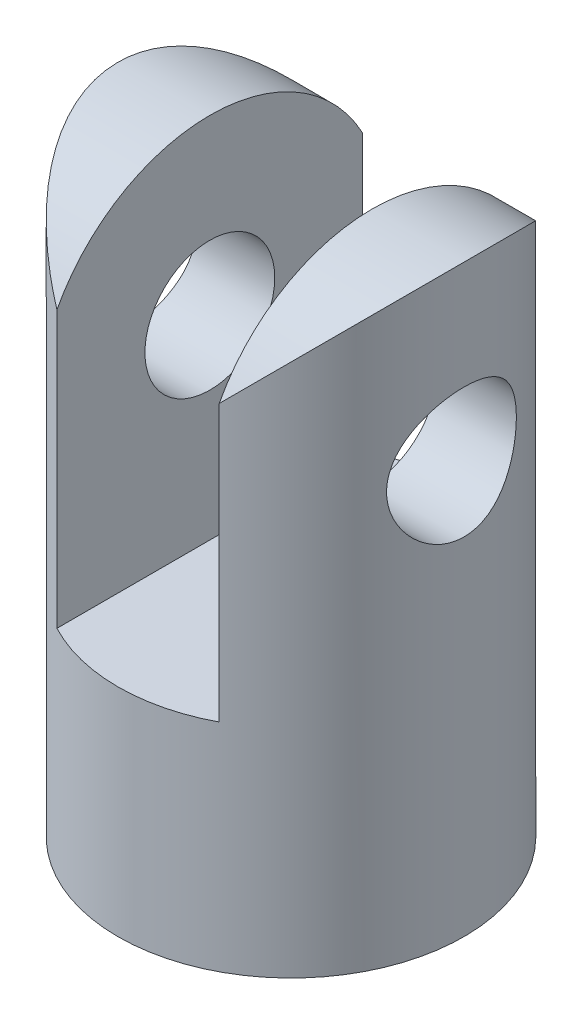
ISO-10303-21;
HEADER;
FILE_DESCRIPTION(('STEP AP214'),'2;1');
FILE_NAME('part.step','',(''),(''),'','','');
FILE_SCHEMA(('AUTOMOTIVE_DESIGN { 1 0 10303 214 1 1 1 1 }'));
ENDSEC;
DATA;
#1=APPLICATION_CONTEXT('core data for automotive mechanical design processes');
#2=APPLICATION_PROTOCOL_DEFINITION('international standard','automotive_design',2000,#1);
#3=PRODUCT_CONTEXT('',#1,'mechanical');
#4=PRODUCT('Part','Part','',(#3));
#5=PRODUCT_RELATED_PRODUCT_CATEGORY('part','',(#4));
#6=PRODUCT_DEFINITION_FORMATION('','',#4);
#7=PRODUCT_DEFINITION_CONTEXT('part definition',#1,'design');
#8=PRODUCT_DEFINITION('design','',#6,#7);
#9=PRODUCT_DEFINITION_SHAPE('','',#8);
#10=(LENGTH_UNIT() NAMED_UNIT(*) SI_UNIT(.MILLI.,.METRE.));
#11=(NAMED_UNIT(*) PLANE_ANGLE_UNIT() SI_UNIT($,.RADIAN.));
#12=(NAMED_UNIT(*) SI_UNIT($,.STERADIAN.) SOLID_ANGLE_UNIT());
#13=UNCERTAINTY_MEASURE_WITH_UNIT(LENGTH_MEASURE(1.E-05),#10,'distance_accuracy_value','');
#14=(GEOMETRIC_REPRESENTATION_CONTEXT(3) GLOBAL_UNCERTAINTY_ASSIGNED_CONTEXT((#13)) GLOBAL_UNIT_ASSIGNED_CONTEXT((#10,
#11,#12)) REPRESENTATION_CONTEXT('',''));
#15=CARTESIAN_POINT('',(0.,0.,0.));
#16=DIRECTION('',(0.,0.,1.));
#17=DIRECTION('',(1.,0.,0.));
#18=AXIS2_PLACEMENT_3D('',#15,#16,#17);
#19=CARTESIAN_POINT('',(0.,10.0000001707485,-2.));
#20=DIRECTION('',(0.,1.,0.));
#21=DIRECTION('',(0.,0.,1.));
#22=AXIS2_PLACEMENT_3D('',#19,#20,#21);
#23=CONICAL_SURFACE('',#22,2.99999217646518,0.78539683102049);
#24=CARTESIAN_POINT('',(0.,8.500003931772,-2.));
#25=DIRECTION('',(0.,1.,0.));
#26=DIRECTION('',(0.,0.,1.));
#27=AXIS2_PLACEMENT_3D('',#24,#25,#26);
#28=CIRCLE('',#27,1.5);
#29=CARTESIAN_POINT('',(0.,8.500003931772,-0.5));
#30=VERTEX_POINT('',#29);
#31=EDGE_CURVE('E86',#30,#30,#28,.F.);
#32=ORIENTED_EDGE('',*,*,#31,.T.);
#33=EDGE_LOOP('',(#32));
#34=FACE_BOUND('',#33,.T.);
#35=CARTESIAN_POINT('',(0.,10.0000001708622,-2.));
#36=DIRECTION('',(0.,1.,0.));
#37=DIRECTION('',(0.,0.,1.));
#38=AXIS2_PLACEMENT_3D('',#35,#36,#37);
#39=CIRCLE('',#38,2.99999217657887);
#40=CARTESIAN_POINT('',(0.,10.0000001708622,0.999992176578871));
#41=VERTEX_POINT('',#40);
#42=EDGE_CURVE('E21',#41,#41,#39,.T.);
#43=ORIENTED_EDGE('',*,*,#42,.T.);
#44=EDGE_LOOP('',(#43));
#45=FACE_BOUND('',#44,.T.);
#46=ADVANCED_FACE('F16',(#34,#45),#23,.F.);
#47=CARTESIAN_POINT('',(0.,0.,-2.));
#48=DIRECTION('',(0.,1.,0.));
#49=DIRECTION('',(0.,0.,1.));
#50=AXIS2_PLACEMENT_3D('',#47,#48,#49);
#51=CYLINDRICAL_SURFACE('',#50,1.5);
#52=CARTESIAN_POINT('',(0.,0.,-2.));
#53=DIRECTION('',(0.,1.,0.));
#54=DIRECTION('',(0.,0.,1.));
#55=AXIS2_PLACEMENT_3D('',#52,#53,#54);
#56=CIRCLE('',#55,1.5);
#57=CARTESIAN_POINT('',(0.,0.,-0.5));
#58=VERTEX_POINT('',#57);
#59=EDGE_CURVE('E122',#58,#58,#56,.F.);
#60=ORIENTED_EDGE('',*,*,#59,.T.);
#61=EDGE_LOOP('',(#60));
#62=FACE_BOUND('',#61,.T.);
#63=ORIENTED_EDGE('',*,*,#31,.F.);
#64=EDGE_LOOP('',(#63));
#65=FACE_BOUND('',#64,.T.);
#66=ADVANCED_FACE('F150',(#62,#65),#51,.F.);
#67=CARTESIAN_POINT('',(-3.75,10.,-9.6));
#68=DIRECTION('',(0.,-1.,0.));
#69=DIRECTION('',(0.,0.,-1.));
#70=AXIS2_PLACEMENT_3D('',#67,#68,#69);
#71=PLANE('',#70);
#72=ORIENTED_EDGE('',*,*,#42,.F.);
#73=EDGE_LOOP('',(#72));
#74=FACE_BOUND('',#73,.T.);
#75=CARTESIAN_POINT('',(0.,10.,0.));
#76=DIRECTION('',(0.,1.,0.));
#77=DIRECTION('',(0.,0.,1.));
#78=AXIS2_PLACEMENT_3D('',#75,#76,#77);
#79=CIRCLE('',#78,8.);
#80=CARTESIAN_POINT('',(3.74999947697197,10.,7.06664729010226));
#81=VERTEX_POINT('',#80);
#82=CARTESIAN_POINT('',(-3.75,10.,7.06664732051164));
#83=VERTEX_POINT('',#82);
#84=EDGE_CURVE('E58',#81,#83,#79,.F.);
#85=ORIENTED_EDGE('',*,*,#84,.F.);
#86=DIRECTION('',(0.,0.,-1.));
#87=VECTOR('',#86,1.);
#88=CARTESIAN_POINT('',(3.75,10.,-9.6));
#89=LINE('',#88,#87);
#90=CARTESIAN_POINT('',(3.74999978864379,10.,-7.06664712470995));
#91=VERTEX_POINT('',#90);
#92=EDGE_CURVE('E83',#81,#91,#89,.T.);
#93=ORIENTED_EDGE('',*,*,#92,.T.);
#94=CARTESIAN_POINT('',(0.,10.,0.));
#95=DIRECTION('',(0.,1.,0.));
#96=DIRECTION('',(0.,0.,1.));
#97=AXIS2_PLACEMENT_3D('',#94,#95,#96);
#98=CIRCLE('',#97,8.);
#99=CARTESIAN_POINT('',(-3.7499995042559,10.,-7.06664727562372));
#100=VERTEX_POINT('',#99);
#101=EDGE_CURVE('E61',#100,#91,#98,.F.);
#102=ORIENTED_EDGE('',*,*,#101,.F.);
#103=DIRECTION('',(0.,0.,1.));
#104=VECTOR('',#103,1.);
#105=CARTESIAN_POINT('',(-3.75,10.,-9.6));
#106=LINE('',#105,#104);
#107=EDGE_CURVE('E54',#100,#83,#106,.T.);
#108=ORIENTED_EDGE('',*,*,#107,.T.);
#109=EDGE_LOOP('',(#85,#93,#102,#108));
#110=FACE_BOUND('',#109,.T.);
#111=ADVANCED_FACE('F56',(#74,#110),#71,.F.);
#112=CARTESIAN_POINT('',(3.75,10.,-9.6));
#113=DIRECTION('',(1.,0.,0.));
#114=DIRECTION('',(0.,0.,-1.));
#115=AXIS2_PLACEMENT_3D('',#112,#113,#114);
#116=PLANE('',#115);
#117=CARTESIAN_POINT('',(3.75,19.,0.));
#118=DIRECTION('',(1.,0.,0.));
#119=DIRECTION('',(0.,0.,-1.));
#120=AXIS2_PLACEMENT_3D('',#117,#118,#119);
#121=CIRCLE('',#120,3.);
#122=CARTESIAN_POINT('',(3.75,19.,-3.));
#123=VERTEX_POINT('',#122);
#124=EDGE_CURVE('E125',#123,#123,#121,.T.);
#125=ORIENTED_EDGE('',*,*,#124,.T.);
#126=EDGE_LOOP('',(#125));
#127=FACE_BOUND('',#126,.T.);
#128=DIRECTION('',(0.,1.,0.));
#129=VECTOR('',#128,1.);
#130=CARTESIAN_POINT('',(3.74999895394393,0.,7.06664756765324));
#131=LINE('',#130,#129);
#132=CARTESIAN_POINT('',(3.74999937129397,22.749999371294,7.06664734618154));
#133=VERTEX_POINT('',#132);
#134=EDGE_CURVE('E71',#133,#81,#131,.F.);
#135=ORIENTED_EDGE('',*,*,#134,.F.);
#136=CARTESIAN_POINT('',(3.749999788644,19.,0.));
#137=DIRECTION('',(1.,0.,0.));
#138=DIRECTION('',(0.,0.,-1.));
#139=AXIS2_PLACEMENT_3D('',#136,#137,#138);
#140=CIRCLE('',#139,8.);
#141=CARTESIAN_POINT('',(3.74999968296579,22.7499996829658,-7.06664718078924));
#142=VERTEX_POINT('',#141);
#143=EDGE_CURVE('E85',#142,#133,#140,.T.);
#144=ORIENTED_EDGE('',*,*,#143,.F.);
#145=DIRECTION('',(0.,1.,0.));
#146=VECTOR('',#145,1.);
#147=CARTESIAN_POINT('',(3.74999957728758,0.,-7.06664723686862));
#148=LINE('',#147,#146);
#149=EDGE_CURVE('E79',#91,#142,#148,.T.);
#150=ORIENTED_EDGE('',*,*,#149,.F.);
#151=ORIENTED_EDGE('',*,*,#92,.F.);
#152=EDGE_LOOP('',(#135,#144,#150,#151));
#153=FACE_BOUND('',#152,.T.);
#154=ADVANCED_FACE('F133',(#127,#153),#116,.F.);
#155=CARTESIAN_POINT('',(-9.6,19.,0.));
#156=DIRECTION('',(1.,0.,0.));
#157=DIRECTION('',(0.,0.,-1.));
#158=AXIS2_PLACEMENT_3D('',#155,#156,#157);
#159=CYLINDRICAL_SURFACE('',#158,8.);
#160=CARTESIAN_POINT('',(0.,19.,0.));
#161=DIRECTION('',(-0.707106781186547,0.707106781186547,0.));
#162=DIRECTION('',(0.707106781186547,0.707106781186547,0.));
#163=AXIS2_PLACEMENT_3D('',#160,#161,#162);
#164=ELLIPSE('',#163,11.3137084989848,8.);
#165=EDGE_CURVE('E81',#142,#133,#164,.F.);
#166=ORIENTED_EDGE('',*,*,#165,.F.);
#167=ORIENTED_EDGE('',*,*,#143,.T.);
#168=EDGE_LOOP('',(#166,#167));
#169=FACE_BOUND('',#168,.T.);
#170=ADVANCED_FACE('F130',(#169),#159,.T.);
#171=CARTESIAN_POINT('',(-9.6,19.,0.));
#172=DIRECTION('',(1.,0.,0.));
#173=DIRECTION('',(0.,0.,-1.));
#174=AXIS2_PLACEMENT_3D('',#171,#172,#173);
#175=CYLINDRICAL_SURFACE('',#174,3.);
#176=CARTESIAN_POINT('',(8.,22.,0.));
#177=CARTESIAN_POINT('',(7.99999492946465,21.9999934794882,-0.16232755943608));
#178=CARTESIAN_POINT('',(7.99500990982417,21.9867699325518,-0.324727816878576));
#179=CARTESIAN_POINT('',(7.97559017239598,21.9343842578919,-0.644773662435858));
#180=CARTESIAN_POINT('',(7.96114781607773,21.8952011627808,-0.802415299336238));
#181=CARTESIAN_POINT('',(7.92437426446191,21.7924883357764,-1.10813129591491));
#182=CARTESIAN_POINT('',(7.90206133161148,21.7290149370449,-1.25622687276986));
#183=CARTESIAN_POINT('',(7.85177031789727,21.5797713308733,-1.53962511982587));
#184=CARTESIAN_POINT('',(7.82379177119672,21.4939992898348,-1.67492673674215));
#185=CARTESIAN_POINT('',(7.76372757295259,21.2987838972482,-1.93468081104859));
#186=CARTESIAN_POINT('',(7.73152567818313,21.1885599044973,-2.05851946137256));
#187=CARTESIAN_POINT('',(7.66721011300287,20.9492008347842,-2.28647030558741));
#188=CARTESIAN_POINT('',(7.6350964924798,20.8200566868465,-2.39057298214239));
#189=CARTESIAN_POINT('',(7.57323518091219,20.5405053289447,-2.58000679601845));
#190=CARTESIAN_POINT('',(7.54362600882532,20.3894713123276,-2.66446186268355));
#191=CARTESIAN_POINT('',(7.49197773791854,20.0741399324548,-2.80642653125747));
#192=CARTESIAN_POINT('',(7.46992889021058,19.9098599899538,-2.86397086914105));
#193=CARTESIAN_POINT('',(7.44116056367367,19.6207613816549,-2.9377189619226));
#194=CARTESIAN_POINT('',(7.43186693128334,19.4979664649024,-2.96101901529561));
#195=CARTESIAN_POINT('',(7.41938373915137,19.2501287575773,-2.99216110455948));
#196=CARTESIAN_POINT('',(7.41619333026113,19.1250862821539,-3.00000529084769));
#197=CARTESIAN_POINT('',(7.4162051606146,18.8381244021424,-2.99999315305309));
#198=CARTESIAN_POINT('',(7.42156352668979,18.6761754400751,-2.98684059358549));
#199=CARTESIAN_POINT('',(7.44230592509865,18.3570695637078,-2.93476263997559));
#200=CARTESIAN_POINT('',(7.45769876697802,18.1999169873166,-2.89581459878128));
#201=CARTESIAN_POINT('',(7.49651217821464,17.8952405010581,-2.79378777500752));
#202=CARTESIAN_POINT('',(7.51991053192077,17.7476912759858,-2.73077571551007));
#203=CARTESIAN_POINT('',(7.57206748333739,17.4652313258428,-2.58262240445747));
#204=CARTESIAN_POINT('',(7.60082675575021,17.3303221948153,-2.49747836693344));
#205=CARTESIAN_POINT('',(7.66206885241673,17.0702312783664,-2.30294203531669));
#206=CARTESIAN_POINT('',(7.69466122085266,16.9457647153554,-2.19262773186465));
#207=CARTESIAN_POINT('',(7.75898947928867,16.7165723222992,-1.95281314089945));
#208=CARTESIAN_POINT('',(7.79072503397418,16.6118541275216,-1.82330546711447));
#209=CARTESIAN_POINT('',(7.85107092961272,16.4216791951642,-1.54333099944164));
#210=CARTESIAN_POINT('',(7.87953626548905,16.3370086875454,-1.39229659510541));
#211=CARTESIAN_POINT('',(7.92877829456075,16.1946452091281,-1.07695249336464));
#212=CARTESIAN_POINT('',(7.94956432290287,16.1369194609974,-0.912659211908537));
#213=CARTESIAN_POINT('',(7.97662871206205,16.0627549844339,-0.623107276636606));
#214=CARTESIAN_POINT('',(7.98534151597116,16.0392755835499,-0.499835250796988));
#215=CARTESIAN_POINT('',(7.99702882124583,16.0078963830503,-0.251056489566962));
#216=CARTESIAN_POINT('',(8.00000392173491,15.999994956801,-0.125549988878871));
#217=CARTESIAN_POINT('',(7.99999492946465,16.0000065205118,0.162327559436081));
#218=CARTESIAN_POINT('',(7.99500990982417,16.0132300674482,0.324727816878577));
#219=CARTESIAN_POINT('',(7.97559017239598,16.0656157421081,0.644773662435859));
#220=CARTESIAN_POINT('',(7.96114781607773,16.1047988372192,0.802415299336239));
#221=CARTESIAN_POINT('',(7.92437426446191,16.2075116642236,1.10813129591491));
#222=CARTESIAN_POINT('',(7.90206133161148,16.2709850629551,1.25622687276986));
#223=CARTESIAN_POINT('',(7.85177031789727,16.4202286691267,1.53962511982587));
#224=CARTESIAN_POINT('',(7.82379177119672,16.5060007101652,1.67492673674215));
#225=CARTESIAN_POINT('',(7.76372757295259,16.7012161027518,1.93468081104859));
#226=CARTESIAN_POINT('',(7.73152567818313,16.8114400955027,2.05851946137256));
#227=CARTESIAN_POINT('',(7.66721011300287,17.0507991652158,2.28647030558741));
#228=CARTESIAN_POINT('',(7.6350964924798,17.1799433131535,2.39057298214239));
#229=CARTESIAN_POINT('',(7.57323518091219,17.4594946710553,2.58000679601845));
#230=CARTESIAN_POINT('',(7.54362600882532,17.6105286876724,2.66446186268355));
#231=CARTESIAN_POINT('',(7.49197773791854,17.9258600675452,2.80642653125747));
#232=CARTESIAN_POINT('',(7.46992889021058,18.0901400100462,2.86397086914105));
#233=CARTESIAN_POINT('',(7.44116056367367,18.3792386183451,2.9377189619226));
#234=CARTESIAN_POINT('',(7.43186693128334,18.5020335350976,2.96101901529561));
#235=CARTESIAN_POINT('',(7.41938373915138,18.7498712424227,2.99216110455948));
#236=CARTESIAN_POINT('',(7.41619333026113,18.8749137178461,3.00000529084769));
#237=CARTESIAN_POINT('',(7.4162051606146,19.1618755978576,2.99999315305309));
#238=CARTESIAN_POINT('',(7.42156352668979,19.3238245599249,2.98684059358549));
#239=CARTESIAN_POINT('',(7.44230592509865,19.6429304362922,2.93476263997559));
#240=CARTESIAN_POINT('',(7.45769876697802,19.8000830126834,2.89581459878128));
#241=CARTESIAN_POINT('',(7.49651217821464,20.1047594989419,2.79378777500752));
#242=CARTESIAN_POINT('',(7.51991053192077,20.2523087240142,2.73077571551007));
#243=CARTESIAN_POINT('',(7.57206748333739,20.5347686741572,2.58262240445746));
#244=CARTESIAN_POINT('',(7.60082675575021,20.6696778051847,2.49747836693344));
#245=CARTESIAN_POINT('',(7.66206885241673,20.9297687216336,2.30294203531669));
#246=CARTESIAN_POINT('',(7.69466122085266,21.0542352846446,2.19262773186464));
#247=CARTESIAN_POINT('',(7.75898947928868,21.2834276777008,1.95281314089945));
#248=CARTESIAN_POINT('',(7.79072503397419,21.3881458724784,1.82330546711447));
#249=CARTESIAN_POINT('',(7.85107092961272,21.5783208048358,1.54333099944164));
#250=CARTESIAN_POINT('',(7.87953626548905,21.6629913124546,1.39229659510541));
#251=CARTESIAN_POINT('',(7.92877829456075,21.8053547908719,1.07695249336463));
#252=CARTESIAN_POINT('',(7.94956432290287,21.8630805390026,0.912659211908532));
#253=CARTESIAN_POINT('',(7.97662871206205,21.9372450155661,0.623107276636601));
#254=CARTESIAN_POINT('',(7.98534151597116,21.9607244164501,0.499835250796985));
#255=CARTESIAN_POINT('',(7.99702882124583,21.9921036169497,0.251056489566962));
#256=CARTESIAN_POINT('',(8.00000392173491,22.000005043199,0.125549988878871));
#257=CARTESIAN_POINT('',(8.,22.,0.));
#258=B_SPLINE_CURVE_WITH_KNOTS('',3,(#176,#177,#178,#179,#180,#181,#182,#183,#184,#185,#186,
#187,#188,#189,#190,#191,#192,#193,#194,#195,#196,#197,#198,#199,#200,#201,#202,#203,#204,#205,
#206,#207,#208,#209,#210,#211,#212,#213,#214,#215,#216,#217,#218,#219,#220,#221,#222,#223,#224,
#225,#226,#227,#228,#229,#230,#231,#232,#233,#234,#235,#236,#237,#238,#239,#240,#241,#242,#243,
#244,#245,#246,#247,#248,#249,#250,#251,#252,#253,#254,#255,#256,#257),.UNSPECIFIED.,.T.,.F.,(4,
2,2,2,2,2,2,2,2,2,2,2,2,2,2,2,2,2,2,2,2,2,2,2,2,2,2,2,2,2,2,2,2,2,2,2,2,2,2,2,4),(0.,
0.486507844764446,0.973409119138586,1.45918796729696,1.94500677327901,2.44942812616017,
2.95409211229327,3.4781679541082,4.00156544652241,4.37650693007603,4.75139624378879,
5.23654482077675,5.7221198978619,6.20635826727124,6.69065762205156,7.1968455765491,
7.7032288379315,8.22702625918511,8.75018482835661,9.12650683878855,9.50278955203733,
9.98929739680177,10.4761986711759,10.9619775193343,11.4477963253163,11.9522176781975,
12.4568816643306,12.9809575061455,13.5043549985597,13.8792964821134,14.2541857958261,
14.7393343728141,15.2249094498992,15.7091478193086,16.1934471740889,16.6996351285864,
17.2060183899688,17.7298158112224,18.2529743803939,18.6292963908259,19.0055791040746),.UNSPECIFIED.);
#259=CARTESIAN_POINT('',(8.,22.,0.));
#260=VERTEX_POINT('',#259);
#261=EDGE_CURVE('E134',#260,#260,#258,.T.);
#262=ORIENTED_EDGE('',*,*,#261,.F.);
#263=EDGE_LOOP('',(#262));
#264=FACE_BOUND('',#263,.T.);
#265=ORIENTED_EDGE('',*,*,#124,.F.);
#266=EDGE_LOOP('',(#265));
#267=FACE_BOUND('',#266,.T.);
#268=ADVANCED_FACE('F138',(#264,#267),#175,.F.);
#269=CARTESIAN_POINT('',(0.,0.,0.));
#270=DIRECTION('',(0.,1.,0.));
#271=DIRECTION('',(0.,0.,1.));
#272=AXIS2_PLACEMENT_3D('',#269,#270,#271);
#273=PLANE('',#272);
#274=ORIENTED_EDGE('',*,*,#59,.F.);
#275=EDGE_LOOP('',(#274));
#276=FACE_BOUND('',#275,.T.);
#277=CARTESIAN_POINT('',(0.,0.,0.));
#278=DIRECTION('',(0.,1.,0.));
#279=DIRECTION('',(0.,0.,1.));
#280=AXIS2_PLACEMENT_3D('',#277,#278,#279);
#281=CIRCLE('',#280,8.);
#282=CARTESIAN_POINT('',(0.,0.,8.));
#283=VERTEX_POINT('',#282);
#284=EDGE_CURVE('E96',#283,#283,#281,.T.);
#285=ORIENTED_EDGE('',*,*,#284,.F.);
#286=EDGE_LOOP('',(#285));
#287=FACE_BOUND('',#286,.T.);
#288=ADVANCED_FACE('F104',(#276,#287),#273,.F.);
#289=CARTESIAN_POINT('',(-9.6,19.,0.));
#290=DIRECTION('',(1.,0.,0.));
#291=DIRECTION('',(0.,0.,-1.));
#292=AXIS2_PLACEMENT_3D('',#289,#290,#291);
#293=CYLINDRICAL_SURFACE('',#292,3.);
#294=CARTESIAN_POINT('',(-8.,16.,0.));
#295=CARTESIAN_POINT('',(-7.99999492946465,16.0000065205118,-0.162327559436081));
#296=CARTESIAN_POINT('',(-7.99500990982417,16.0132300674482,-0.324727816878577));
#297=CARTESIAN_POINT('',(-7.97559017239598,16.0656157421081,-0.644773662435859));
#298=CARTESIAN_POINT('',(-7.96114781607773,16.1047988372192,-0.802415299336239));
#299=CARTESIAN_POINT('',(-7.92437426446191,16.2075116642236,-1.10813129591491));
#300=CARTESIAN_POINT('',(-7.90206133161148,16.2709850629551,-1.25622687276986));
#301=CARTESIAN_POINT('',(-7.85177031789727,16.4202286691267,-1.53962511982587));
#302=CARTESIAN_POINT('',(-7.82379177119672,16.5060007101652,-1.67492673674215));
#303=CARTESIAN_POINT('',(-7.76372757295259,16.7012161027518,-1.93468081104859));
#304=CARTESIAN_POINT('',(-7.73152567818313,16.8114400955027,-2.05851946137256));
#305=CARTESIAN_POINT('',(-7.66721011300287,17.0507991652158,-2.28647030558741));
#306=CARTESIAN_POINT('',(-7.6350964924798,17.1799433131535,-2.39057298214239));
#307=CARTESIAN_POINT('',(-7.57323518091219,17.4594946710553,-2.58000679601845));
#308=CARTESIAN_POINT('',(-7.54362600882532,17.6105286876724,-2.66446186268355));
#309=CARTESIAN_POINT('',(-7.49197773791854,17.9258600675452,-2.80642653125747));
#310=CARTESIAN_POINT('',(-7.46992889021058,18.0901400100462,-2.86397086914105));
#311=CARTESIAN_POINT('',(-7.44116056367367,18.3792386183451,-2.9377189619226));
#312=CARTESIAN_POINT('',(-7.43186693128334,18.5020335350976,-2.96101901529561));
#313=CARTESIAN_POINT('',(-7.41938373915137,18.7498712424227,-2.99216110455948));
#314=CARTESIAN_POINT('',(-7.41619333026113,18.8749137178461,-3.00000529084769));
#315=CARTESIAN_POINT('',(-7.4162051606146,19.1618755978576,-2.99999315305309));
#316=CARTESIAN_POINT('',(-7.42156352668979,19.3238245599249,-2.98684059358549));
#317=CARTESIAN_POINT('',(-7.44230592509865,19.6429304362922,-2.93476263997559));
#318=CARTESIAN_POINT('',(-7.45769876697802,19.8000830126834,-2.89581459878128));
#319=CARTESIAN_POINT('',(-7.49651217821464,20.1047594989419,-2.79378777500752));
#320=CARTESIAN_POINT('',(-7.51991053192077,20.2523087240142,-2.73077571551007));
#321=CARTESIAN_POINT('',(-7.57206748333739,20.5347686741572,-2.58262240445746));
#322=CARTESIAN_POINT('',(-7.60082675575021,20.6696778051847,-2.49747836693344));
#323=CARTESIAN_POINT('',(-7.66206885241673,20.9297687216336,-2.30294203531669));
#324=CARTESIAN_POINT('',(-7.69466122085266,21.0542352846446,-2.19262773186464));
#325=CARTESIAN_POINT('',(-7.75898947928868,21.2834276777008,-1.95281314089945));
#326=CARTESIAN_POINT('',(-7.79072503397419,21.3881458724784,-1.82330546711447));
#327=CARTESIAN_POINT('',(-7.85107092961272,21.5783208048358,-1.54333099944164));
#328=CARTESIAN_POINT('',(-7.87953626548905,21.6629913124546,-1.39229659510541));
#329=CARTESIAN_POINT('',(-7.92877829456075,21.8053547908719,-1.07695249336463));
#330=CARTESIAN_POINT('',(-7.94956432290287,21.8630805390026,-0.912659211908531));
#331=CARTESIAN_POINT('',(-7.97662871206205,21.9372450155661,-0.6231072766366));
#332=CARTESIAN_POINT('',(-7.98534151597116,21.9607244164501,-0.499835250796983));
#333=CARTESIAN_POINT('',(-7.99702882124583,21.9921036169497,-0.25105648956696));
#334=CARTESIAN_POINT('',(-8.00000392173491,22.000005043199,-0.12554998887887));
#335=CARTESIAN_POINT('',(-7.99999492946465,21.9999934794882,0.162327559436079));
#336=CARTESIAN_POINT('',(-7.99500990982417,21.9867699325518,0.324727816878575));
#337=CARTESIAN_POINT('',(-7.97559017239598,21.9343842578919,0.644773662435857));
#338=CARTESIAN_POINT('',(-7.96114781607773,21.8952011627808,0.802415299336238));
#339=CARTESIAN_POINT('',(-7.92437426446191,21.7924883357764,1.10813129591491));
#340=CARTESIAN_POINT('',(-7.90206133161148,21.7290149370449,1.25622687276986));
#341=CARTESIAN_POINT('',(-7.85177031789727,21.5797713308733,1.53962511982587));
#342=CARTESIAN_POINT('',(-7.82379177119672,21.4939992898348,1.67492673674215));
#343=CARTESIAN_POINT('',(-7.76372757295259,21.2987838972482,1.93468081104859));
#344=CARTESIAN_POINT('',(-7.73152567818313,21.1885599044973,2.05851946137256));
#345=CARTESIAN_POINT('',(-7.66721011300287,20.9492008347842,2.28647030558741));
#346=CARTESIAN_POINT('',(-7.6350964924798,20.8200566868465,2.39057298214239));
#347=CARTESIAN_POINT('',(-7.57323518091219,20.5405053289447,2.58000679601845));
#348=CARTESIAN_POINT('',(-7.54362600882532,20.3894713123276,2.66446186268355));
#349=CARTESIAN_POINT('',(-7.49197773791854,20.0741399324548,2.80642653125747));
#350=CARTESIAN_POINT('',(-7.46992889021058,19.9098599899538,2.86397086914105));
#351=CARTESIAN_POINT('',(-7.44116056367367,19.6207613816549,2.9377189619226));
#352=CARTESIAN_POINT('',(-7.43186693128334,19.4979664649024,2.96101901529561));
#353=CARTESIAN_POINT('',(-7.41938373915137,19.2501287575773,2.99216110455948));
#354=CARTESIAN_POINT('',(-7.41619333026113,19.1250862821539,3.00000529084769));
#355=CARTESIAN_POINT('',(-7.4162051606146,18.8381244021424,2.99999315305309));
#356=CARTESIAN_POINT('',(-7.42156352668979,18.6761754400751,2.98684059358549));
#357=CARTESIAN_POINT('',(-7.44230592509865,18.3570695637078,2.93476263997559));
#358=CARTESIAN_POINT('',(-7.45769876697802,18.1999169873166,2.89581459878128));
#359=CARTESIAN_POINT('',(-7.49651217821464,17.8952405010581,2.79378777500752));
#360=CARTESIAN_POINT('',(-7.51991053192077,17.7476912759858,2.73077571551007));
#361=CARTESIAN_POINT('',(-7.57206748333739,17.4652313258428,2.58262240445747));
#362=CARTESIAN_POINT('',(-7.60082675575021,17.3303221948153,2.49747836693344));
#363=CARTESIAN_POINT('',(-7.66206885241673,17.0702312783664,2.30294203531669));
#364=CARTESIAN_POINT('',(-7.69466122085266,16.9457647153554,2.19262773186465));
#365=CARTESIAN_POINT('',(-7.75898947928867,16.7165723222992,1.95281314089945));
#366=CARTESIAN_POINT('',(-7.79072503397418,16.6118541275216,1.82330546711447));
#367=CARTESIAN_POINT('',(-7.85107092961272,16.4216791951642,1.54333099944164));
#368=CARTESIAN_POINT('',(-7.87953626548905,16.3370086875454,1.39229659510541));
#369=CARTESIAN_POINT('',(-7.92877829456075,16.1946452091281,1.07695249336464));
#370=CARTESIAN_POINT('',(-7.94956432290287,16.1369194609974,0.912659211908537));
#371=CARTESIAN_POINT('',(-7.97662871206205,16.0627549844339,0.623107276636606));
#372=CARTESIAN_POINT('',(-7.98534151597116,16.0392755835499,0.499835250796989));
#373=CARTESIAN_POINT('',(-7.99702882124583,16.0078963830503,0.251056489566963));
#374=CARTESIAN_POINT('',(-8.00000392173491,15.999994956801,0.125549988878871));
#375=CARTESIAN_POINT('',(-8.,16.,0.));
#376=B_SPLINE_CURVE_WITH_KNOTS('',3,(#294,#295,#296,#297,#298,#299,#300,#301,#302,#303,#304,
#305,#306,#307,#308,#309,#310,#311,#312,#313,#314,#315,#316,#317,#318,#319,#320,#321,#322,#323,
#324,#325,#326,#327,#328,#329,#330,#331,#332,#333,#334,#335,#336,#337,#338,#339,#340,#341,#342,
#343,#344,#345,#346,#347,#348,#349,#350,#351,#352,#353,#354,#355,#356,#357,#358,#359,#360,#361,
#362,#363,#364,#365,#366,#367,#368,#369,#370,#371,#372,#373,#374,#375),.UNSPECIFIED.,.T.,.F.,(4,
2,2,2,2,2,2,2,2,2,2,2,2,2,2,2,2,2,2,2,2,2,2,2,2,2,2,2,2,2,2,2,2,2,2,2,2,2,2,2,4),(0.,
0.486507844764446,0.973409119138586,1.45918796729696,1.94500677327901,2.44942812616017,
2.95409211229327,3.4781679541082,4.00156544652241,4.37650693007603,4.7513962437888,
5.23654482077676,5.7221198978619,6.20635826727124,6.69065762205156,7.19684557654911,
7.7032288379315,8.22702625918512,8.75018482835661,9.12650683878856,9.50278955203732,
9.98929739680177,10.4761986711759,10.9619775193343,11.4477963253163,11.9522176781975,
12.4568816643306,12.9809575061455,13.5043549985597,13.8792964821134,14.2541857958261,
14.7393343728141,15.2249094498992,15.7091478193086,16.1934471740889,16.6996351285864,
17.2060183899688,17.7298158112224,18.2529743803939,18.6292963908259,19.0055791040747),.UNSPECIFIED.);
#377=CARTESIAN_POINT('',(-8.,16.,0.));
#378=VERTEX_POINT('',#377);
#379=EDGE_CURVE('E90',#378,#378,#376,.T.);
#380=ORIENTED_EDGE('',*,*,#379,.F.);
#381=EDGE_LOOP('',(#380));
#382=FACE_BOUND('',#381,.T.);
#383=CARTESIAN_POINT('',(-3.75,19.,0.));
#384=DIRECTION('',(1.,0.,0.));
#385=DIRECTION('',(0.,0.,-1.));
#386=AXIS2_PLACEMENT_3D('',#383,#384,#385);
#387=CIRCLE('',#386,3.);
#388=CARTESIAN_POINT('',(-3.75,19.,-3.));
#389=VERTEX_POINT('',#388);
#390=EDGE_CURVE('E75',#389,#389,#387,.T.);
#391=ORIENTED_EDGE('',*,*,#390,.T.);
#392=EDGE_LOOP('',(#391));
#393=FACE_BOUND('',#392,.T.);
#394=ADVANCED_FACE('F98',(#382,#393),#293,.F.);
#395=CARTESIAN_POINT('',(-9.6,19.,0.));
#396=DIRECTION('',(1.,0.,0.));
#397=DIRECTION('',(0.,0.,-1.));
#398=AXIS2_PLACEMENT_3D('',#395,#396,#397);
#399=CYLINDRICAL_SURFACE('',#398,8.);
#400=CARTESIAN_POINT('',(0.,19.,0.));
#401=DIRECTION('',(0.707106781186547,0.707106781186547,0.));
#402=DIRECTION('',(-0.707106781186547,0.707106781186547,0.));
#403=AXIS2_PLACEMENT_3D('',#400,#401,#402);
#404=ELLIPSE('',#403,11.3137084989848,8.);
#405=CARTESIAN_POINT('',(-3.7499998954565,22.7499994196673,7.066647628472));
#406=VERTEX_POINT('',#405);
#407=CARTESIAN_POINT('',(-3.7499993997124,22.7499993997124,-7.06664733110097));
#408=VERTEX_POINT('',#407);
#409=EDGE_CURVE('E27',#406,#408,#404,.F.);
#410=ORIENTED_EDGE('',*,*,#409,.F.);
#411=CARTESIAN_POINT('',(-3.749999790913,19.,0.));
#412=DIRECTION('',(1.,0.,0.));
#413=DIRECTION('',(0.,0.,-1.));
#414=AXIS2_PLACEMENT_3D('',#411,#412,#413);
#415=CIRCLE('',#414,8.);
#416=EDGE_CURVE('E35',#406,#408,#415,.F.);
#417=ORIENTED_EDGE('',*,*,#416,.T.);
#418=EDGE_LOOP('',(#410,#417));
#419=FACE_BOUND('',#418,.T.);
#420=ADVANCED_FACE('F103',(#419),#399,.T.);
#421=CARTESIAN_POINT('',(-3.75,27.,-9.6));
#422=DIRECTION('',(-1.,0.,0.));
#423=DIRECTION('',(0.,0.,1.));
#424=AXIS2_PLACEMENT_3D('',#421,#422,#423);
#425=PLANE('',#424);
#426=ORIENTED_EDGE('',*,*,#390,.F.);
#427=EDGE_LOOP('',(#426));
#428=FACE_BOUND('',#427,.T.);
#429=DIRECTION('',(0.,1.,0.));
#430=VECTOR('',#429,1.);
#431=CARTESIAN_POINT('',(-3.75,27.,7.066647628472));
#432=LINE('',#431,#430);
#433=EDGE_CURVE('E64',#83,#406,#432,.T.);
#434=ORIENTED_EDGE('',*,*,#433,.F.);
#435=ORIENTED_EDGE('',*,*,#107,.F.);
#436=DIRECTION('',(0.,1.,0.));
#437=VECTOR('',#436,1.);
#438=CARTESIAN_POINT('',(-3.7499990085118,0.,-7.06664753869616));
#439=LINE('',#438,#437);
#440=EDGE_CURVE('E11',#408,#100,#439,.F.);
#441=ORIENTED_EDGE('',*,*,#440,.F.);
#442=ORIENTED_EDGE('',*,*,#416,.F.);
#443=EDGE_LOOP('',(#434,#435,#441,#442));
#444=FACE_BOUND('',#443,.T.);
#445=ADVANCED_FACE('F73',(#428,#444),#425,.F.);
#446=CARTESIAN_POINT('',(0.,0.,0.));
#447=DIRECTION('',(0.,1.,0.));
#448=DIRECTION('',(0.,0.,1.));
#449=AXIS2_PLACEMENT_3D('',#446,#447,#448);
#450=CYLINDRICAL_SURFACE('',#449,8.);
#451=ORIENTED_EDGE('',*,*,#261,.T.);
#452=EDGE_LOOP('',(#451));
#453=FACE_BOUND('',#452,.T.);
#454=ORIENTED_EDGE('',*,*,#284,.T.);
#455=EDGE_LOOP('',(#454));
#456=FACE_BOUND('',#455,.T.);
#457=ORIENTED_EDGE('',*,*,#379,.T.);
#458=EDGE_LOOP('',(#457));
#459=FACE_BOUND('',#458,.T.);
#460=ORIENTED_EDGE('',*,*,#409,.T.);
#461=ORIENTED_EDGE('',*,*,#440,.T.);
#462=ORIENTED_EDGE('',*,*,#101,.T.);
#463=ORIENTED_EDGE('',*,*,#149,.T.);
#464=ORIENTED_EDGE('',*,*,#165,.T.);
#465=ORIENTED_EDGE('',*,*,#134,.T.);
#466=ORIENTED_EDGE('',*,*,#84,.T.);
#467=ORIENTED_EDGE('',*,*,#433,.T.);
#468=EDGE_LOOP('',(#460,#461,#462,#463,#464,#465,#466,#467));
#469=FACE_BOUND('',#468,.T.);
#470=ADVANCED_FACE('F18',(#453,#456,#459,#469),#450,.T.);
#471=CLOSED_SHELL('',(#46,#66,#111,#154,#170,#268,#288,#394,#420,#445,#470));
#472=MANIFOLD_SOLID_BREP('B1',#471);
#473=ADVANCED_BREP_SHAPE_REPRESENTATION('',(#18,#472),#14);
#474=SHAPE_DEFINITION_REPRESENTATION(#9,#473);
ENDSEC;
END-ISO-10303-21;
